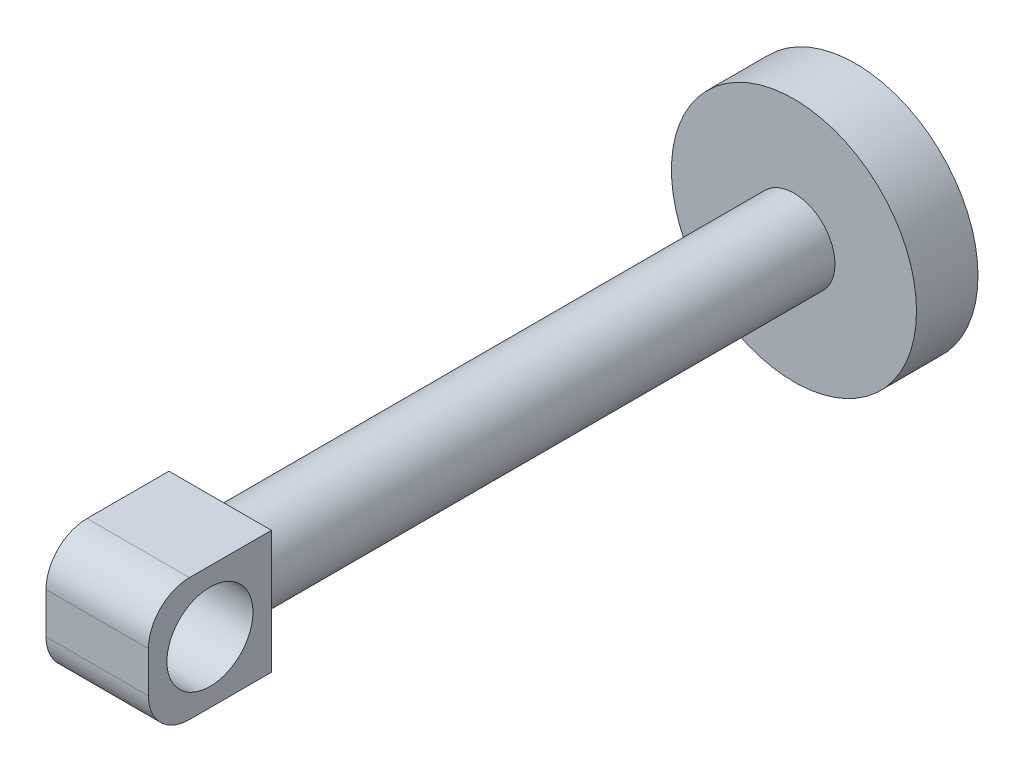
ISO-10303-21;
HEADER;
FILE_DESCRIPTION(('STEP AP214'),'2;1');
FILE_NAME('part.step','',(''),(''),'','','');
FILE_SCHEMA(('AUTOMOTIVE_DESIGN { 1 0 10303 214 1 1 1 1 }'));
ENDSEC;
DATA;
#1=APPLICATION_CONTEXT('core data for automotive mechanical design processes');
#2=APPLICATION_PROTOCOL_DEFINITION('international standard','automotive_design',2000,#1);
#3=PRODUCT_CONTEXT('',#1,'mechanical');
#4=PRODUCT('Part','Part','',(#3));
#5=PRODUCT_RELATED_PRODUCT_CATEGORY('part','',(#4));
#6=PRODUCT_DEFINITION_FORMATION('','',#4);
#7=PRODUCT_DEFINITION_CONTEXT('part definition',#1,'design');
#8=PRODUCT_DEFINITION('design','',#6,#7);
#9=PRODUCT_DEFINITION_SHAPE('','',#8);
#10=(LENGTH_UNIT() NAMED_UNIT(*) SI_UNIT(.MILLI.,.METRE.));
#11=(NAMED_UNIT(*) PLANE_ANGLE_UNIT() SI_UNIT($,.RADIAN.));
#12=(NAMED_UNIT(*) SI_UNIT($,.STERADIAN.) SOLID_ANGLE_UNIT());
#13=UNCERTAINTY_MEASURE_WITH_UNIT(LENGTH_MEASURE(1.E-05),#10,'distance_accuracy_value','');
#14=(GEOMETRIC_REPRESENTATION_CONTEXT(3) GLOBAL_UNCERTAINTY_ASSIGNED_CONTEXT((#13)) GLOBAL_UNIT_ASSIGNED_CONTEXT((#10,
#11,#12)) REPRESENTATION_CONTEXT('',''));
#15=CARTESIAN_POINT('',(0.,0.,0.));
#16=DIRECTION('',(0.,0.,1.));
#17=DIRECTION('',(1.,0.,0.));
#18=AXIS2_PLACEMENT_3D('',#15,#16,#17);
#19=CARTESIAN_POINT('',(0.,0.,-19.05));
#20=DIRECTION('',(0.,0.,1.));
#21=DIRECTION('',(1.,0.,0.));
#22=AXIS2_PLACEMENT_3D('',#19,#20,#21);
#23=CYLINDRICAL_SURFACE('',#22,37.973);
#24=CARTESIAN_POINT('',(0.,0.,-19.05));
#25=DIRECTION('',(0.,0.,1.));
#26=DIRECTION('',(1.,0.,0.));
#27=AXIS2_PLACEMENT_3D('',#24,#25,#26);
#28=CIRCLE('',#27,37.973);
#29=CARTESIAN_POINT('',(37.973,0.,-19.05));
#30=VERTEX_POINT('',#29);
#31=EDGE_CURVE('E138',#30,#30,#28,.T.);
#32=CARTESIAN_POINT('',(0.,0.,0.));
#33=DIRECTION('',(0.,0.,1.));
#34=DIRECTION('',(1.,0.,0.));
#35=AXIS2_PLACEMENT_3D('',#32,#33,#34);
#36=CIRCLE('',#35,37.973);
#37=CARTESIAN_POINT('',(37.973,0.,0.));
#38=VERTEX_POINT('',#37);
#39=EDGE_CURVE('E133',#38,#38,#36,.T.);
#40=CARTESIAN_POINT('',(37.973,0.,-19.05));
#41=CARTESIAN_POINT('',(37.973,0.,-18.8515625));
#42=CARTESIAN_POINT('',(37.973,0.,-18.653125));
#43=CARTESIAN_POINT('',(37.973,0.,-18.25625));
#44=CARTESIAN_POINT('',(37.973,0.,-18.0578125));
#45=CARTESIAN_POINT('',(37.973,0.,-17.6609375));
#46=CARTESIAN_POINT('',(37.973,0.,-17.4625));
#47=CARTESIAN_POINT('',(37.973,0.,-17.065625));
#48=CARTESIAN_POINT('',(37.973,0.,-16.8671875));
#49=CARTESIAN_POINT('',(37.973,0.,-16.4703125));
#50=CARTESIAN_POINT('',(37.973,0.,-16.271875));
#51=CARTESIAN_POINT('',(37.973,0.,-15.875));
#52=CARTESIAN_POINT('',(37.973,0.,-15.6765625));
#53=CARTESIAN_POINT('',(37.973,0.,-15.2796875));
#54=CARTESIAN_POINT('',(37.973,0.,-15.08125));
#55=CARTESIAN_POINT('',(37.973,0.,-14.684375));
#56=CARTESIAN_POINT('',(37.973,0.,-14.4859375));
#57=CARTESIAN_POINT('',(37.973,0.,-14.0890625));
#58=CARTESIAN_POINT('',(37.973,0.,-13.890625));
#59=CARTESIAN_POINT('',(37.973,0.,-13.49375));
#60=CARTESIAN_POINT('',(37.973,0.,-13.2953125));
#61=CARTESIAN_POINT('',(37.973,0.,-12.8984375));
#62=CARTESIAN_POINT('',(37.973,0.,-12.7));
#63=CARTESIAN_POINT('',(37.973,0.,-12.303125));
#64=CARTESIAN_POINT('',(37.973,0.,-12.1046875));
#65=CARTESIAN_POINT('',(37.973,0.,-11.7078125));
#66=CARTESIAN_POINT('',(37.973,0.,-11.509375));
#67=CARTESIAN_POINT('',(37.973,0.,-11.1125));
#68=CARTESIAN_POINT('',(37.973,0.,-10.9140625));
#69=CARTESIAN_POINT('',(37.973,0.,-10.5171875));
#70=CARTESIAN_POINT('',(37.973,0.,-10.31875));
#71=CARTESIAN_POINT('',(37.973,0.,-9.921875));
#72=CARTESIAN_POINT('',(37.973,0.,-9.7234375));
#73=CARTESIAN_POINT('',(37.973,0.,-9.3265625));
#74=CARTESIAN_POINT('',(37.973,0.,-9.128125));
#75=CARTESIAN_POINT('',(37.973,0.,-8.73125));
#76=CARTESIAN_POINT('',(37.973,0.,-8.5328125));
#77=CARTESIAN_POINT('',(37.973,0.,-8.1359375));
#78=CARTESIAN_POINT('',(37.973,0.,-7.9375));
#79=CARTESIAN_POINT('',(37.973,0.,-7.540625));
#80=CARTESIAN_POINT('',(37.973,0.,-7.3421875));
#81=CARTESIAN_POINT('',(37.973,0.,-6.9453125));
#82=CARTESIAN_POINT('',(37.973,0.,-6.746875));
#83=CARTESIAN_POINT('',(37.973,0.,-6.35));
#84=CARTESIAN_POINT('',(37.973,0.,-6.1515625));
#85=CARTESIAN_POINT('',(37.973,0.,-5.7546875));
#86=CARTESIAN_POINT('',(37.973,0.,-5.55625));
#87=CARTESIAN_POINT('',(37.973,0.,-5.159375));
#88=CARTESIAN_POINT('',(37.973,0.,-4.9609375));
#89=CARTESIAN_POINT('',(37.973,0.,-4.5640625));
#90=CARTESIAN_POINT('',(37.973,0.,-4.365625));
#91=CARTESIAN_POINT('',(37.973,0.,-3.96875));
#92=CARTESIAN_POINT('',(37.973,0.,-3.7703125));
#93=CARTESIAN_POINT('',(37.973,0.,-3.3734375));
#94=CARTESIAN_POINT('',(37.973,0.,-3.175));
#95=CARTESIAN_POINT('',(37.973,0.,-2.778125));
#96=CARTESIAN_POINT('',(37.973,0.,-2.5796875));
#97=CARTESIAN_POINT('',(37.973,0.,-2.1828125));
#98=CARTESIAN_POINT('',(37.973,0.,-1.984375));
#99=CARTESIAN_POINT('',(37.973,0.,-1.5875));
#100=CARTESIAN_POINT('',(37.973,0.,-1.3890625));
#101=CARTESIAN_POINT('',(37.973,0.,-0.992187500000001));
#102=CARTESIAN_POINT('',(37.973,0.,-0.793750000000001));
#103=CARTESIAN_POINT('',(37.973,0.,-0.396875));
#104=CARTESIAN_POINT('',(37.973,0.,-0.1984375));
#105=CARTESIAN_POINT('',(37.973,0.,0.));
#106=B_SPLINE_CURVE_WITH_KNOTS('',3,(#40,#41,#42,#43,#44,#45,#46,#47,#48,#49,#50,#51,#52,#53,
#54,#55,#56,#57,#58,#59,#60,#61,#62,#63,#64,#65,#66,#67,#68,#69,#70,#71,#72,#73,#74,#75,#76,#77,
#78,#79,#80,#81,#82,#83,#84,#85,#86,#87,#88,#89,#90,#91,#92,#93,#94,#95,#96,#97,#98,#99,#100,
#101,#102,#103,#104,#105),.UNSPECIFIED.,.F.,.F.,(4,2,2,2,2,2,2,2,2,2,2,2,2,2,2,2,2,2,2,2,2,2,2,
2,2,2,2,2,2,2,2,2,4),(0.,0.595312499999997,1.190625,1.7859375,2.38125,2.9765625,3.571875,
4.1671875,4.7625,5.3578125,5.953125,6.5484375,7.14375,7.7390625,8.334375,8.9296875,9.525,
10.1203125,10.715625,11.3109375,11.90625,12.5015625,13.096875,13.6921875,14.2875,14.8828125,
15.478125,16.0734375,16.66875,17.2640625,17.859375,18.4546875,19.05),.UNSPECIFIED.);
#107=EDGE_CURVE('BSEAM38',#30,#38,#106,.T.);
#108=ORIENTED_EDGE('',*,*,#31,.T.);
#109=ORIENTED_EDGE('',*,*,#39,.F.);
#110=ORIENTED_EDGE('',*,*,#107,.T.);
#111=ORIENTED_EDGE('',*,*,#107,.F.);
#112=EDGE_LOOP('',(#108,#110,#109,#111));
#113=FACE_BOUND('',#112,.T.);
#114=ADVANCED_FACE('F38',(#113),#23,.T.);
#115=CARTESIAN_POINT('',(0.,0.,-19.05));
#116=DIRECTION('',(0.,0.,1.));
#117=DIRECTION('',(1.,0.,0.));
#118=AXIS2_PLACEMENT_3D('',#115,#116,#117);
#119=PLANE('',#118);
#120=ORIENTED_EDGE('',*,*,#31,.F.);
#121=EDGE_LOOP('',(#120));
#122=FACE_BOUND('',#121,.T.);
#123=ADVANCED_FACE('F185',(#122),#119,.F.);
#124=CARTESIAN_POINT('',(0.,0.,0.));
#125=DIRECTION('',(0.,0.,1.));
#126=DIRECTION('',(1.,0.,0.));
#127=AXIS2_PLACEMENT_3D('',#124,#125,#126);
#128=PLANE('',#127);
#129=CARTESIAN_POINT('',(0.,0.,0.));
#130=DIRECTION('',(0.,0.,1.));
#131=DIRECTION('',(1.,0.,0.));
#132=AXIS2_PLACEMENT_3D('',#129,#130,#131);
#133=CIRCLE('',#132,12.7);
#134=CARTESIAN_POINT('',(12.7,0.,0.));
#135=VERTEX_POINT('',#134);
#136=EDGE_CURVE('E134',#135,#135,#133,.T.);
#137=ORIENTED_EDGE('',*,*,#136,.F.);
#138=EDGE_LOOP('',(#137));
#139=FACE_BOUND('',#138,.T.);
#140=ORIENTED_EDGE('',*,*,#39,.T.);
#141=EDGE_LOOP('',(#140));
#142=FACE_BOUND('',#141,.T.);
#143=ADVANCED_FACE('F181',(#139,#142),#128,.T.);
#144=CARTESIAN_POINT('',(0.,0.,177.8));
#145=DIRECTION('',(0.,0.,-1.));
#146=DIRECTION('',(-1.,0.,0.));
#147=AXIS2_PLACEMENT_3D('',#144,#145,#146);
#148=CYLINDRICAL_SURFACE('',#147,12.7);
#149=CARTESIAN_POINT('',(0.,0.,177.8));
#150=DIRECTION('',(0.,0.,1.));
#151=DIRECTION('',(1.,0.,0.));
#152=AXIS2_PLACEMENT_3D('',#149,#150,#151);
#153=CIRCLE('',#152,12.7);
#154=CARTESIAN_POINT('',(12.7,0.,177.8));
#155=VERTEX_POINT('',#154);
#156=EDGE_CURVE('E101',#155,#155,#153,.T.);
#157=ORIENTED_EDGE('',*,*,#156,.F.);
#158=EDGE_LOOP('',(#157));
#159=FACE_BOUND('',#158,.T.);
#160=ORIENTED_EDGE('',*,*,#136,.T.);
#161=EDGE_LOOP('',(#160));
#162=FACE_BOUND('',#161,.T.);
#163=ADVANCED_FACE('F174',(#159,#162),#148,.T.);
#164=CARTESIAN_POINT('',(15.875,-19.05,215.9));
#165=DIRECTION('',(-1.,0.,0.));
#166=DIRECTION('',(0.,0.,1.));
#167=AXIS2_PLACEMENT_3D('',#164,#165,#166);
#168=PLANE('',#167);
#169=CARTESIAN_POINT('',(15.875,0.,196.85));
#170=DIRECTION('',(1.,0.,0.));
#171=DIRECTION('',(0.,0.,-1.));
#172=AXIS2_PLACEMENT_3D('',#169,#170,#171);
#173=CIRCLE('',#172,13.335);
#174=CARTESIAN_POINT('',(15.875,0.,183.515));
#175=VERTEX_POINT('',#174);
#176=EDGE_CURVE('E118',#175,#175,#173,.T.);
#177=ORIENTED_EDGE('',*,*,#176,.F.);
#178=EDGE_LOOP('',(#177));
#179=FACE_BOUND('',#178,.T.);
#180=DIRECTION('',(0.,1.,0.));
#181=VECTOR('',#180,1.);
#182=CARTESIAN_POINT('',(15.875,-19.05,215.9));
#183=LINE('',#182,#181);
#184=CARTESIAN_POINT('',(15.875,-6.35,215.9));
#185=VERTEX_POINT('',#184);
#186=CARTESIAN_POINT('',(15.875,6.35,215.9));
#187=VERTEX_POINT('',#186);
#188=EDGE_CURVE('E126',#185,#187,#183,.T.);
#189=ORIENTED_EDGE('',*,*,#188,.F.);
#190=CARTESIAN_POINT('',(15.875,-6.35,203.2));
#191=DIRECTION('',(-1.,0.,0.));
#192=DIRECTION('',(0.,0.,1.));
#193=AXIS2_PLACEMENT_3D('',#190,#191,#192);
#194=CIRCLE('',#193,12.7);
#195=CARTESIAN_POINT('',(15.875,-19.05,203.2));
#196=VERTEX_POINT('',#195);
#197=EDGE_CURVE('E150',#185,#196,#194,.F.);
#198=ORIENTED_EDGE('',*,*,#197,.T.);
#199=DIRECTION('',(0.,0.,-1.));
#200=VECTOR('',#199,1.);
#201=CARTESIAN_POINT('',(15.875,-19.05,215.9));
#202=LINE('',#201,#200);
#203=CARTESIAN_POINT('',(15.875,-19.05,177.8));
#204=VERTEX_POINT('',#203);
#205=EDGE_CURVE('E114',#196,#204,#202,.T.);
#206=ORIENTED_EDGE('',*,*,#205,.T.);
#207=DIRECTION('',(0.,1.,0.));
#208=VECTOR('',#207,1.);
#209=CARTESIAN_POINT('',(15.875,-19.05,177.8));
#210=LINE('',#209,#208);
#211=CARTESIAN_POINT('',(15.875,19.05,177.8));
#212=VERTEX_POINT('',#211);
#213=EDGE_CURVE('E108',#204,#212,#210,.T.);
#214=ORIENTED_EDGE('',*,*,#213,.T.);
#215=DIRECTION('',(0.,0.,-1.));
#216=VECTOR('',#215,1.);
#217=CARTESIAN_POINT('',(15.875,19.05,215.9));
#218=LINE('',#217,#216);
#219=CARTESIAN_POINT('',(15.875,19.05,203.2));
#220=VERTEX_POINT('',#219);
#221=EDGE_CURVE('E92',#220,#212,#218,.T.);
#222=ORIENTED_EDGE('',*,*,#221,.F.);
#223=CARTESIAN_POINT('',(15.875,6.35,203.2));
#224=DIRECTION('',(-1.,0.,0.));
#225=DIRECTION('',(0.,0.,1.));
#226=AXIS2_PLACEMENT_3D('',#223,#224,#225);
#227=CIRCLE('',#226,12.7);
#228=EDGE_CURVE('E148',#220,#187,#227,.F.);
#229=ORIENTED_EDGE('',*,*,#228,.T.);
#230=EDGE_LOOP('',(#189,#198,#206,#214,#222,#229));
#231=FACE_BOUND('',#230,.T.);
#232=ADVANCED_FACE('F113',(#179,#231),#168,.F.);
#233=CARTESIAN_POINT('',(-15.875,19.05,215.9));
#234=DIRECTION('',(0.,-1.,0.));
#235=DIRECTION('',(0.,0.,-1.));
#236=AXIS2_PLACEMENT_3D('',#233,#234,#235);
#237=PLANE('',#236);
#238=DIRECTION('',(0.,0.,-1.));
#239=VECTOR('',#238,1.);
#240=CARTESIAN_POINT('',(-15.875,19.05,215.9));
#241=LINE('',#240,#239);
#242=CARTESIAN_POINT('',(-15.875,19.05,203.2));
#243=VERTEX_POINT('',#242);
#244=CARTESIAN_POINT('',(-15.875,19.05,177.8));
#245=VERTEX_POINT('',#244);
#246=EDGE_CURVE('E102',#243,#245,#241,.T.);
#247=ORIENTED_EDGE('',*,*,#246,.F.);
#248=DIRECTION('',(-1.,0.,0.));
#249=VECTOR('',#248,1.);
#250=CARTESIAN_POINT('',(-15.875,19.05,203.2));
#251=LINE('',#250,#249);
#252=EDGE_CURVE('E11',#243,#220,#251,.F.);
#253=ORIENTED_EDGE('',*,*,#252,.T.);
#254=ORIENTED_EDGE('',*,*,#221,.T.);
#255=DIRECTION('',(-1.,0.,0.));
#256=VECTOR('',#255,1.);
#257=CARTESIAN_POINT('',(-15.875,19.05,177.8));
#258=LINE('',#257,#256);
#259=EDGE_CURVE('E95',#212,#245,#258,.T.);
#260=ORIENTED_EDGE('',*,*,#259,.T.);
#261=EDGE_LOOP('',(#247,#253,#254,#260));
#262=FACE_BOUND('',#261,.T.);
#263=ADVANCED_FACE('F94',(#262),#237,.F.);
#264=CARTESIAN_POINT('',(-15.875,-19.05,215.9));
#265=DIRECTION('',(1.,0.,0.));
#266=DIRECTION('',(0.,0.,-1.));
#267=AXIS2_PLACEMENT_3D('',#264,#265,#266);
#268=PLANE('',#267);
#269=CARTESIAN_POINT('',(-15.875,0.,196.85));
#270=DIRECTION('',(1.,0.,0.));
#271=DIRECTION('',(0.,0.,-1.));
#272=AXIS2_PLACEMENT_3D('',#269,#270,#271);
#273=CIRCLE('',#272,13.335);
#274=CARTESIAN_POINT('',(-15.875,0.,183.515));
#275=VERTEX_POINT('',#274);
#276=EDGE_CURVE('E42',#275,#275,#273,.T.);
#277=ORIENTED_EDGE('',*,*,#276,.T.);
#278=EDGE_LOOP('',(#277));
#279=FACE_BOUND('',#278,.T.);
#280=DIRECTION('',(0.,0.,-1.));
#281=VECTOR('',#280,1.);
#282=CARTESIAN_POINT('',(-15.875,-19.05,215.9));
#283=LINE('',#282,#281);
#284=CARTESIAN_POINT('',(-15.875,-19.05,203.2));
#285=VERTEX_POINT('',#284);
#286=CARTESIAN_POINT('',(-15.875,-19.05,177.8));
#287=VERTEX_POINT('',#286);
#288=EDGE_CURVE('E128',#285,#287,#283,.T.);
#289=ORIENTED_EDGE('',*,*,#288,.F.);
#290=CARTESIAN_POINT('',(-15.875,-6.35,203.2));
#291=DIRECTION('',(1.,0.,0.));
#292=DIRECTION('',(0.,0.,-1.));
#293=AXIS2_PLACEMENT_3D('',#290,#291,#292);
#294=CIRCLE('',#293,12.7);
#295=CARTESIAN_POINT('',(-15.875,-6.35,215.9));
#296=VERTEX_POINT('',#295);
#297=EDGE_CURVE('E47',#285,#296,#294,.F.);
#298=ORIENTED_EDGE('',*,*,#297,.T.);
#299=DIRECTION('',(0.,-1.,0.));
#300=VECTOR('',#299,1.);
#301=CARTESIAN_POINT('',(-15.875,-19.05,215.9));
#302=LINE('',#301,#300);
#303=CARTESIAN_POINT('',(-15.875,6.35,215.9));
#304=VERTEX_POINT('',#303);
#305=EDGE_CURVE('E120',#304,#296,#302,.T.);
#306=ORIENTED_EDGE('',*,*,#305,.F.);
#307=CARTESIAN_POINT('',(-15.875,6.35,203.2));
#308=DIRECTION('',(1.,0.,0.));
#309=DIRECTION('',(0.,0.,-1.));
#310=AXIS2_PLACEMENT_3D('',#307,#308,#309);
#311=CIRCLE('',#310,12.7);
#312=EDGE_CURVE('E54',#304,#243,#311,.F.);
#313=ORIENTED_EDGE('',*,*,#312,.T.);
#314=ORIENTED_EDGE('',*,*,#246,.T.);
#315=DIRECTION('',(0.,-1.,0.));
#316=VECTOR('',#315,1.);
#317=CARTESIAN_POINT('',(-15.875,-19.05,177.8));
#318=LINE('',#317,#316);
#319=EDGE_CURVE('E110',#245,#287,#318,.T.);
#320=ORIENTED_EDGE('',*,*,#319,.T.);
#321=EDGE_LOOP('',(#289,#298,#306,#313,#314,#320));
#322=FACE_BOUND('',#321,.T.);
#323=ADVANCED_FACE('F156',(#279,#322),#268,.F.);
#324=CARTESIAN_POINT('',(-15.875,-19.05,215.9));
#325=DIRECTION('',(0.,1.,0.));
#326=DIRECTION('',(0.,0.,1.));
#327=AXIS2_PLACEMENT_3D('',#324,#325,#326);
#328=PLANE('',#327);
#329=ORIENTED_EDGE('',*,*,#205,.F.);
#330=DIRECTION('',(1.,0.,0.));
#331=VECTOR('',#330,1.);
#332=CARTESIAN_POINT('',(-15.875,-19.05,203.2));
#333=LINE('',#332,#331);
#334=EDGE_CURVE('E62',#196,#285,#333,.F.);
#335=ORIENTED_EDGE('',*,*,#334,.T.);
#336=ORIENTED_EDGE('',*,*,#288,.T.);
#337=DIRECTION('',(1.,0.,0.));
#338=VECTOR('',#337,1.);
#339=CARTESIAN_POINT('',(-15.875,-19.05,177.8));
#340=LINE('',#339,#338);
#341=EDGE_CURVE('E124',#287,#204,#340,.T.);
#342=ORIENTED_EDGE('',*,*,#341,.T.);
#343=EDGE_LOOP('',(#329,#335,#336,#342));
#344=FACE_BOUND('',#343,.T.);
#345=ADVANCED_FACE('F164',(#344),#328,.F.);
#346=CARTESIAN_POINT('',(0.,0.,215.9));
#347=DIRECTION('',(0.,0.,-1.));
#348=DIRECTION('',(-1.,0.,0.));
#349=AXIS2_PLACEMENT_3D('',#346,#347,#348);
#350=PLANE('',#349);
#351=ORIENTED_EDGE('',*,*,#305,.T.);
#352=DIRECTION('',(1.,0.,0.));
#353=VECTOR('',#352,1.);
#354=CARTESIAN_POINT('',(0.,-6.35,215.9));
#355=LINE('',#354,#353);
#356=EDGE_CURVE('E145',#296,#185,#355,.T.);
#357=ORIENTED_EDGE('',*,*,#356,.T.);
#358=ORIENTED_EDGE('',*,*,#188,.T.);
#359=DIRECTION('',(-1.,0.,0.));
#360=VECTOR('',#359,1.);
#361=CARTESIAN_POINT('',(0.,6.35,215.9));
#362=LINE('',#361,#360);
#363=EDGE_CURVE('E137',#187,#304,#362,.T.);
#364=ORIENTED_EDGE('',*,*,#363,.T.);
#365=EDGE_LOOP('',(#351,#357,#358,#364));
#366=FACE_BOUND('',#365,.T.);
#367=ADVANCED_FACE('F160',(#366),#350,.F.);
#368=CARTESIAN_POINT('',(0.,0.,177.8));
#369=DIRECTION('',(0.,0.,-1.));
#370=DIRECTION('',(-1.,0.,0.));
#371=AXIS2_PLACEMENT_3D('',#368,#369,#370);
#372=PLANE('',#371);
#373=ORIENTED_EDGE('',*,*,#156,.T.);
#374=EDGE_LOOP('',(#373));
#375=FACE_BOUND('',#374,.T.);
#376=ORIENTED_EDGE('',*,*,#213,.F.);
#377=ORIENTED_EDGE('',*,*,#341,.F.);
#378=ORIENTED_EDGE('',*,*,#319,.F.);
#379=ORIENTED_EDGE('',*,*,#259,.F.);
#380=EDGE_LOOP('',(#376,#377,#378,#379));
#381=FACE_BOUND('',#380,.T.);
#382=ADVANCED_FACE('F106',(#375,#381),#372,.T.);
#383=CARTESIAN_POINT('',(0.,-6.35,203.2));
#384=DIRECTION('',(1.,0.,0.));
#385=DIRECTION('',(0.,0.,-1.));
#386=AXIS2_PLACEMENT_3D('',#383,#384,#385);
#387=CYLINDRICAL_SURFACE('',#386,12.7);
#388=ORIENTED_EDGE('',*,*,#297,.F.);
#389=ORIENTED_EDGE('',*,*,#334,.F.);
#390=ORIENTED_EDGE('',*,*,#197,.F.);
#391=ORIENTED_EDGE('',*,*,#356,.F.);
#392=EDGE_LOOP('',(#388,#389,#390,#391));
#393=FACE_BOUND('',#392,.T.);
#394=ADVANCED_FACE('F163',(#393),#387,.T.);
#395=CARTESIAN_POINT('',(0.,6.35,203.2));
#396=DIRECTION('',(-1.,0.,0.));
#397=DIRECTION('',(0.,0.,1.));
#398=AXIS2_PLACEMENT_3D('',#395,#396,#397);
#399=CYLINDRICAL_SURFACE('',#398,12.7);
#400=ORIENTED_EDGE('',*,*,#228,.F.);
#401=ORIENTED_EDGE('',*,*,#252,.F.);
#402=ORIENTED_EDGE('',*,*,#312,.F.);
#403=ORIENTED_EDGE('',*,*,#363,.F.);
#404=EDGE_LOOP('',(#400,#401,#402,#403));
#405=FACE_BOUND('',#404,.T.);
#406=ADVANCED_FACE('F40',(#405),#399,.T.);
#407=CARTESIAN_POINT('',(-22.225,0.,196.85));
#408=DIRECTION('',(1.,0.,0.));
#409=DIRECTION('',(0.,0.,-1.));
#410=AXIS2_PLACEMENT_3D('',#407,#408,#409);
#411=CYLINDRICAL_SURFACE('',#410,13.335);
#412=CARTESIAN_POINT('',(15.875,0.,183.515));
#413=CARTESIAN_POINT('',(15.5442708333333,0.,183.515));
#414=CARTESIAN_POINT('',(15.2135416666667,0.,183.515));
#415=CARTESIAN_POINT('',(14.5520833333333,0.,183.515));
#416=CARTESIAN_POINT('',(14.2213541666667,0.,183.515));
#417=CARTESIAN_POINT('',(13.5598958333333,0.,183.515));
#418=CARTESIAN_POINT('',(13.2291666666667,0.,183.515));
#419=CARTESIAN_POINT('',(12.5677083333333,0.,183.515));
#420=CARTESIAN_POINT('',(12.2369791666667,0.,183.515));
#421=CARTESIAN_POINT('',(11.5755208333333,0.,183.515));
#422=CARTESIAN_POINT('',(11.2447916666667,0.,183.515));
#423=CARTESIAN_POINT('',(10.5833333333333,0.,183.515));
#424=CARTESIAN_POINT('',(10.2526041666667,0.,183.515));
#425=CARTESIAN_POINT('',(9.59114583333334,0.,183.515));
#426=CARTESIAN_POINT('',(9.26041666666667,0.,183.515));
#427=CARTESIAN_POINT('',(8.59895833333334,0.,183.515));
#428=CARTESIAN_POINT('',(8.26822916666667,0.,183.515));
#429=CARTESIAN_POINT('',(7.60677083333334,0.,183.515));
#430=CARTESIAN_POINT('',(7.27604166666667,0.,183.515));
#431=CARTESIAN_POINT('',(6.61458333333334,0.,183.515));
#432=CARTESIAN_POINT('',(6.28385416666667,0.,183.515));
#433=CARTESIAN_POINT('',(5.62239583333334,0.,183.515));
#434=CARTESIAN_POINT('',(5.29166666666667,0.,183.515));
#435=CARTESIAN_POINT('',(4.63020833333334,0.,183.515));
#436=CARTESIAN_POINT('',(4.29947916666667,0.,183.515));
#437=CARTESIAN_POINT('',(3.63802083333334,0.,183.515));
#438=CARTESIAN_POINT('',(3.30729166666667,0.,183.515));
#439=CARTESIAN_POINT('',(2.64583333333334,0.,183.515));
#440=CARTESIAN_POINT('',(2.31510416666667,0.,183.515));
#441=CARTESIAN_POINT('',(1.65364583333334,0.,183.515));
#442=CARTESIAN_POINT('',(1.32291666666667,0.,183.515));
#443=CARTESIAN_POINT('',(0.661458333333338,0.,183.515));
#444=CARTESIAN_POINT('',(0.330729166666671,0.,183.515));
#445=CARTESIAN_POINT('',(-0.330729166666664,0.,183.515));
#446=CARTESIAN_POINT('',(-0.661458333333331,0.,183.515));
#447=CARTESIAN_POINT('',(-1.32291666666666,0.,183.515));
#448=CARTESIAN_POINT('',(-1.65364583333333,0.,183.515));
#449=CARTESIAN_POINT('',(-2.31510416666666,0.,183.515));
#450=CARTESIAN_POINT('',(-2.64583333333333,0.,183.515));
#451=CARTESIAN_POINT('',(-3.30729166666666,0.,183.515));
#452=CARTESIAN_POINT('',(-3.63802083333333,0.,183.515));
#453=CARTESIAN_POINT('',(-4.29947916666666,0.,183.515));
#454=CARTESIAN_POINT('',(-4.63020833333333,0.,183.515));
#455=CARTESIAN_POINT('',(-5.29166666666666,0.,183.515));
#456=CARTESIAN_POINT('',(-5.62239583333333,0.,183.515));
#457=CARTESIAN_POINT('',(-6.28385416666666,0.,183.515));
#458=CARTESIAN_POINT('',(-6.61458333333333,0.,183.515));
#459=CARTESIAN_POINT('',(-7.27604166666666,0.,183.515));
#460=CARTESIAN_POINT('',(-7.60677083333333,0.,183.515));
#461=CARTESIAN_POINT('',(-8.26822916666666,0.,183.515));
#462=CARTESIAN_POINT('',(-8.59895833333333,0.,183.515));
#463=CARTESIAN_POINT('',(-9.26041666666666,0.,183.515));
#464=CARTESIAN_POINT('',(-9.59114583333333,0.,183.515));
#465=CARTESIAN_POINT('',(-10.2526041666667,0.,183.515));
#466=CARTESIAN_POINT('',(-10.5833333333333,0.,183.515));
#467=CARTESIAN_POINT('',(-11.2447916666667,0.,183.515));
#468=CARTESIAN_POINT('',(-11.5755208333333,0.,183.515));
#469=CARTESIAN_POINT('',(-12.2369791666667,0.,183.515));
#470=CARTESIAN_POINT('',(-12.5677083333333,0.,183.515));
#471=CARTESIAN_POINT('',(-13.2291666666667,0.,183.515));
#472=CARTESIAN_POINT('',(-13.5598958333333,0.,183.515));
#473=CARTESIAN_POINT('',(-14.2213541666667,0.,183.515));
#474=CARTESIAN_POINT('',(-14.5520833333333,0.,183.515));
#475=CARTESIAN_POINT('',(-15.2135416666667,0.,183.515));
#476=CARTESIAN_POINT('',(-15.5442708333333,0.,183.515));
#477=CARTESIAN_POINT('',(-15.875,0.,183.515));
#478=B_SPLINE_CURVE_WITH_KNOTS('',3,(#412,#413,#414,#415,#416,#417,#418,#419,#420,#421,#422,
#423,#424,#425,#426,#427,#428,#429,#430,#431,#432,#433,#434,#435,#436,#437,#438,#439,#440,#441,
#442,#443,#444,#445,#446,#447,#448,#449,#450,#451,#452,#453,#454,#455,#456,#457,#458,#459,#460,
#461,#462,#463,#464,#465,#466,#467,#468,#469,#470,#471,#472,#473,#474,#475,#476,#477),
.UNSPECIFIED.,.F.,.F.,(4,2,2,2,2,2,2,2,2,2,2,2,2,2,2,2,2,2,2,2,2,2,2,2,2,2,2,2,2,2,2,2,4),(0.,
0.992187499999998,1.984375,2.9765625,3.96875,4.9609375,5.953125,6.9453125,7.9375,8.9296875,
9.921875,10.9140625,11.90625,12.8984375,13.890625,14.8828125,15.875,16.8671875,17.859375,
18.8515625,19.84375,20.8359375,21.828125,22.8203125,23.8125,24.8046875,25.796875,26.7890625,
27.78125,28.7734375,29.765625,30.7578125,31.75),.UNSPECIFIED.);
#479=EDGE_CURVE('BSEAM170',#175,#275,#478,.T.);
#480=ORIENTED_EDGE('',*,*,#176,.T.);
#481=ORIENTED_EDGE('',*,*,#276,.F.);
#482=ORIENTED_EDGE('',*,*,#479,.T.);
#483=ORIENTED_EDGE('',*,*,#479,.F.);
#484=EDGE_LOOP('',(#480,#482,#481,#483));
#485=FACE_BOUND('',#484,.T.);
#486=ADVANCED_FACE('F170',(#485),#411,.F.);
#487=CLOSED_SHELL('',(#114,#123,#143,#163,#232,#263,#323,#345,#367,#382,#394,#406,#486));
#488=MANIFOLD_SOLID_BREP('B2',#487);
#489=ADVANCED_BREP_SHAPE_REPRESENTATION('',(#18,#488),#14);
#490=SHAPE_DEFINITION_REPRESENTATION(#9,#489);
ENDSEC;
END-ISO-10303-21;
